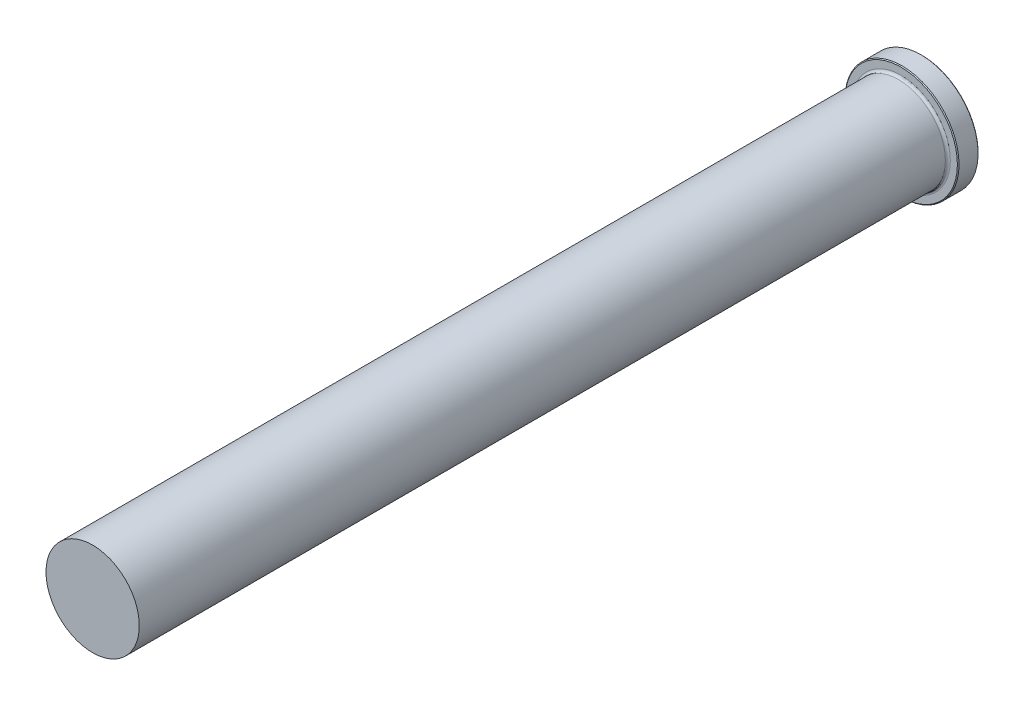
ISO-10303-21;
HEADER;
FILE_DESCRIPTION(('STEP AP214'),'2;1');
FILE_NAME('part.step','',(''),(''),'','','');
FILE_SCHEMA(('AUTOMOTIVE_DESIGN { 1 0 10303 214 1 1 1 1 }'));
ENDSEC;
DATA;
#1=APPLICATION_CONTEXT('core data for automotive mechanical design processes');
#2=APPLICATION_PROTOCOL_DEFINITION('international standard','automotive_design',2000,#1);
#3=PRODUCT_CONTEXT('',#1,'mechanical');
#4=PRODUCT('Part','Part','',(#3));
#5=PRODUCT_RELATED_PRODUCT_CATEGORY('part','',(#4));
#6=PRODUCT_DEFINITION_FORMATION('','',#4);
#7=PRODUCT_DEFINITION_CONTEXT('part definition',#1,'design');
#8=PRODUCT_DEFINITION('design','',#6,#7);
#9=PRODUCT_DEFINITION_SHAPE('','',#8);
#10=(LENGTH_UNIT() NAMED_UNIT(*) SI_UNIT(.MILLI.,.METRE.));
#11=(NAMED_UNIT(*) PLANE_ANGLE_UNIT() SI_UNIT($,.RADIAN.));
#12=(NAMED_UNIT(*) SI_UNIT($,.STERADIAN.) SOLID_ANGLE_UNIT());
#13=UNCERTAINTY_MEASURE_WITH_UNIT(LENGTH_MEASURE(1.E-05),#10,'distance_accuracy_value','');
#14=(GEOMETRIC_REPRESENTATION_CONTEXT(3) GLOBAL_UNCERTAINTY_ASSIGNED_CONTEXT((#13)) GLOBAL_UNIT_ASSIGNED_CONTEXT((#10,
#11,#12)) REPRESENTATION_CONTEXT('',''));
#15=CARTESIAN_POINT('',(0.,0.,0.));
#16=DIRECTION('',(0.,0.,1.));
#17=DIRECTION('',(1.,0.,0.));
#18=AXIS2_PLACEMENT_3D('',#15,#16,#17);
#19=CARTESIAN_POINT('',(0.,0.,0.));
#20=DIRECTION('',(0.,0.,-1.));
#21=DIRECTION('',(-1.,0.,0.));
#22=AXIS2_PLACEMENT_3D('',#19,#20,#21);
#23=PLANE('',#22);
#24=CARTESIAN_POINT('',(0.,0.,0.));
#25=DIRECTION('',(0.,0.,-1.));
#26=DIRECTION('',(-1.,0.,0.));
#27=AXIS2_PLACEMENT_3D('',#24,#25,#26);
#28=CIRCLE('',#27,17.2085);
#29=CARTESIAN_POINT('',(-17.2085,0.,0.));
#30=VERTEX_POINT('',#29);
#31=EDGE_CURVE('E50',#30,#30,#28,.T.);
#32=ORIENTED_EDGE('',*,*,#31,.T.);
#33=EDGE_LOOP('',(#32));
#34=FACE_BOUND('',#33,.T.);
#35=ADVANCED_FACE('F35',(#34),#23,.T.);
#36=CARTESIAN_POINT('',(0.,0.,0.));
#37=DIRECTION('',(0.,0.,-1.));
#38=DIRECTION('',(-1.,0.,0.));
#39=AXIS2_PLACEMENT_3D('',#36,#37,#38);
#40=CYLINDRICAL_SURFACE('',#39,17.4625);
#41=CARTESIAN_POINT('',(0.,0.,0.253999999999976));
#42=DIRECTION('',(0.,0.,-1.));
#43=DIRECTION('',(-1.,0.,0.));
#44=AXIS2_PLACEMENT_3D('',#41,#42,#43);
#45=CIRCLE('',#44,17.4625);
#46=CARTESIAN_POINT('',(-17.4625,0.,0.253999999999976));
#47=VERTEX_POINT('',#46);
#48=EDGE_CURVE('E42',#47,#47,#45,.F.);
#49=ORIENTED_EDGE('',*,*,#48,.T.);
#50=EDGE_LOOP('',(#49));
#51=FACE_BOUND('',#50,.T.);
#52=CARTESIAN_POINT('',(0.,0.,6.096));
#53=DIRECTION('',(0.,0.,1.));
#54=DIRECTION('',(1.,0.,0.));
#55=AXIS2_PLACEMENT_3D('',#52,#53,#54);
#56=CIRCLE('',#55,17.4625);
#57=CARTESIAN_POINT('',(17.4625,0.,6.096));
#58=VERTEX_POINT('',#57);
#59=EDGE_CURVE('E46',#58,#58,#56,.F.);
#60=ORIENTED_EDGE('',*,*,#59,.T.);
#61=EDGE_LOOP('',(#60));
#62=FACE_BOUND('',#61,.T.);
#63=ADVANCED_FACE('F82',(#51,#62),#40,.T.);
#64=CARTESIAN_POINT('',(0.,17.4625,6.35));
#65=DIRECTION('',(0.,0.,1.));
#66=DIRECTION('',(1.,0.,0.));
#67=AXIS2_PLACEMENT_3D('',#64,#65,#66);
#68=PLANE('',#67);
#69=CARTESIAN_POINT('',(0.,0.,6.35));
#70=DIRECTION('',(0.,0.,1.));
#71=DIRECTION('',(1.,0.,0.));
#72=AXIS2_PLACEMENT_3D('',#69,#70,#71);
#73=CIRCLE('',#72,17.2085);
#74=CARTESIAN_POINT('',(17.2085,0.,6.35));
#75=VERTEX_POINT('',#74);
#76=EDGE_CURVE('E10',#75,#75,#73,.T.);
#77=ORIENTED_EDGE('',*,*,#76,.T.);
#78=EDGE_LOOP('',(#77));
#79=FACE_BOUND('',#78,.T.);
#80=CARTESIAN_POINT('',(0.,0.,6.35));
#81=DIRECTION('',(0.,0.,1.));
#82=DIRECTION('',(1.,0.,0.));
#83=AXIS2_PLACEMENT_3D('',#80,#81,#82);
#84=CIRCLE('',#83,15.0495);
#85=CARTESIAN_POINT('',(15.0495,0.,6.35));
#86=VERTEX_POINT('',#85);
#87=EDGE_CURVE('E58',#86,#86,#84,.F.);
#88=ORIENTED_EDGE('',*,*,#87,.T.);
#89=EDGE_LOOP('',(#88));
#90=FACE_BOUND('',#89,.T.);
#91=ADVANCED_FACE('F78',(#79,#90),#68,.T.);
#92=CARTESIAN_POINT('',(0.,0.,0.));
#93=DIRECTION('',(0.,0.,-1.));
#94=DIRECTION('',(-1.,0.,0.));
#95=AXIS2_PLACEMENT_3D('',#92,#93,#94);
#96=CYLINDRICAL_SURFACE('',#95,14.2875);
#97=CARTESIAN_POINT('',(0.,0.,7.112));
#98=DIRECTION('',(0.,0.,1.));
#99=DIRECTION('',(1.,0.,0.));
#100=AXIS2_PLACEMENT_3D('',#97,#98,#99);
#101=CIRCLE('',#100,14.2875);
#102=CARTESIAN_POINT('',(14.2875,0.,7.112));
#103=VERTEX_POINT('',#102);
#104=EDGE_CURVE('E55',#103,#103,#101,.T.);
#105=ORIENTED_EDGE('',*,*,#104,.T.);
#106=EDGE_LOOP('',(#105));
#107=FACE_BOUND('',#106,.T.);
#108=CARTESIAN_POINT('',(0.,0.,254.));
#109=DIRECTION('',(0.,0.,-1.));
#110=DIRECTION('',(-1.,0.,0.));
#111=AXIS2_PLACEMENT_3D('',#108,#109,#110);
#112=CIRCLE('',#111,14.2875);
#113=CARTESIAN_POINT('',(-14.2875,0.,254.));
#114=VERTEX_POINT('',#113);
#115=EDGE_CURVE('E61',#114,#114,#112,.T.);
#116=ORIENTED_EDGE('',*,*,#115,.T.);
#117=EDGE_LOOP('',(#116));
#118=FACE_BOUND('',#117,.T.);
#119=ADVANCED_FACE('F65',(#107,#118),#96,.T.);
#120=CARTESIAN_POINT('',(0.,14.2875,254.));
#121=DIRECTION('',(0.,0.,1.));
#122=DIRECTION('',(1.,0.,0.));
#123=AXIS2_PLACEMENT_3D('',#120,#121,#122);
#124=PLANE('',#123);
#125=ORIENTED_EDGE('',*,*,#115,.F.);
#126=EDGE_LOOP('',(#125));
#127=FACE_BOUND('',#126,.T.);
#128=ADVANCED_FACE('F67',(#127),#124,.T.);
#129=CARTESIAN_POINT('',(0.,0.,7.112));
#130=DIRECTION('',(0.,0.,1.));
#131=DIRECTION('',(1.,0.,0.));
#132=AXIS2_PLACEMENT_3D('',#129,#130,#131);
#133=TOROIDAL_SURFACE('',#132,15.0495,0.762);
#134=ORIENTED_EDGE('',*,*,#104,.F.);
#135=EDGE_LOOP('',(#134));
#136=FACE_BOUND('',#135,.T.);
#137=ORIENTED_EDGE('',*,*,#87,.F.);
#138=EDGE_LOOP('',(#137));
#139=FACE_BOUND('',#138,.T.);
#140=ADVANCED_FACE('F69',(#136,#139),#133,.F.);
#141=CARTESIAN_POINT('',(0.,0.,0.));
#142=DIRECTION('',(0.,0.,1.));
#143=DIRECTION('',(1.,0.,0.));
#144=AXIS2_PLACEMENT_3D('',#141,#142,#143);
#145=CONICAL_SURFACE('',#144,17.2085,0.785398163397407);
#146=ORIENTED_EDGE('',*,*,#48,.F.);
#147=EDGE_LOOP('',(#146));
#148=FACE_BOUND('',#147,.T.);
#149=ORIENTED_EDGE('',*,*,#31,.F.);
#150=EDGE_LOOP('',(#149));
#151=FACE_BOUND('',#150,.T.);
#152=ADVANCED_FACE('F75',(#148,#151),#145,.T.);
#153=CARTESIAN_POINT('',(0.,0.,6.096));
#154=DIRECTION('',(0.,0.,-1.));
#155=DIRECTION('',(-1.,0.,0.));
#156=AXIS2_PLACEMENT_3D('',#153,#154,#155);
#157=CONICAL_SURFACE('',#156,17.4625,0.785398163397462);
#158=ORIENTED_EDGE('',*,*,#76,.F.);
#159=EDGE_LOOP('',(#158));
#160=FACE_BOUND('',#159,.T.);
#161=ORIENTED_EDGE('',*,*,#59,.F.);
#162=EDGE_LOOP('',(#161));
#163=FACE_BOUND('',#162,.T.);
#164=ADVANCED_FACE('F37',(#160,#163),#157,.T.);
#165=CLOSED_SHELL('',(#35,#63,#91,#119,#128,#140,#152,#164));
#166=MANIFOLD_SOLID_BREP('B2',#165);
#167=ADVANCED_BREP_SHAPE_REPRESENTATION('',(#18,#166),#14);
#168=SHAPE_DEFINITION_REPRESENTATION(#9,#167);
ENDSEC;
END-ISO-10303-21;
